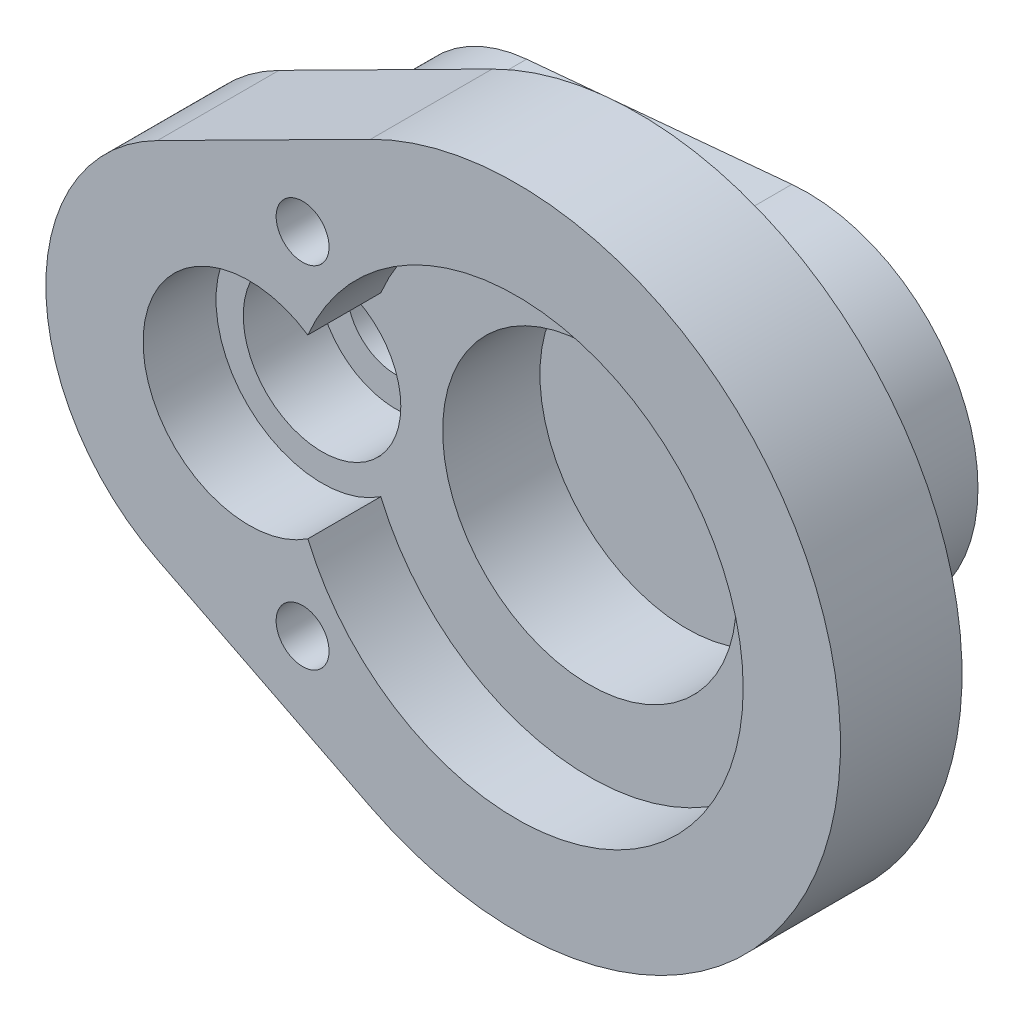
ISO-10303-21;
HEADER;
FILE_DESCRIPTION(('STEP AP214'),'2;1');
FILE_NAME('part.step','',(''),(''),'','','');
FILE_SCHEMA(('AUTOMOTIVE_DESIGN { 1 0 10303 214 1 1 1 1 }'));
ENDSEC;
DATA;
#1=APPLICATION_CONTEXT('core data for automotive mechanical design processes');
#2=APPLICATION_PROTOCOL_DEFINITION('international standard','automotive_design',2000,#1);
#3=PRODUCT_CONTEXT('',#1,'mechanical');
#4=PRODUCT('Part','Part','',(#3));
#5=PRODUCT_RELATED_PRODUCT_CATEGORY('part','',(#4));
#6=PRODUCT_DEFINITION_FORMATION('','',#4);
#7=PRODUCT_DEFINITION_CONTEXT('part definition',#1,'design');
#8=PRODUCT_DEFINITION('design','',#6,#7);
#9=PRODUCT_DEFINITION_SHAPE('','',#8);
#10=(LENGTH_UNIT() NAMED_UNIT(*) SI_UNIT(.MILLI.,.METRE.));
#11=(NAMED_UNIT(*) PLANE_ANGLE_UNIT() SI_UNIT($,.RADIAN.));
#12=(NAMED_UNIT(*) SI_UNIT($,.STERADIAN.) SOLID_ANGLE_UNIT());
#13=UNCERTAINTY_MEASURE_WITH_UNIT(LENGTH_MEASURE(1.E-05),#10,'distance_accuracy_value','');
#14=(GEOMETRIC_REPRESENTATION_CONTEXT(3) GLOBAL_UNCERTAINTY_ASSIGNED_CONTEXT((#13)) GLOBAL_UNIT_ASSIGNED_CONTEXT((#10,
#11,#12)) REPRESENTATION_CONTEXT('',''));
#15=CARTESIAN_POINT('',(0.,0.,0.));
#16=DIRECTION('',(0.,0.,1.));
#17=DIRECTION('',(1.,0.,0.));
#18=AXIS2_PLACEMENT_3D('',#15,#16,#17);
#19=CARTESIAN_POINT('',(-17.4625,0.,0.));
#20=DIRECTION('',(0.,0.,1.));
#21=DIRECTION('',(1.,0.,0.));
#22=AXIS2_PLACEMENT_3D('',#19,#20,#21);
#23=CYLINDRICAL_SURFACE('',#22,3.2004);
#24=CARTESIAN_POINT('',(-17.4625,0.,0.));
#25=DIRECTION('',(0.,0.,1.));
#26=DIRECTION('',(1.,0.,0.));
#27=AXIS2_PLACEMENT_3D('',#24,#25,#26);
#28=CIRCLE('',#27,3.2004);
#29=CARTESIAN_POINT('',(-14.2621,0.,0.));
#30=VERTEX_POINT('',#29);
#31=EDGE_CURVE('E230',#30,#30,#28,.T.);
#32=ORIENTED_EDGE('',*,*,#31,.F.);
#33=EDGE_LOOP('',(#32));
#34=FACE_BOUND('',#33,.T.);
#35=CARTESIAN_POINT('',(-17.4625,0.,9.398));
#36=DIRECTION('',(0.,0.,1.));
#37=DIRECTION('',(1.,0.,0.));
#38=AXIS2_PLACEMENT_3D('',#35,#36,#37);
#39=CIRCLE('',#38,3.2004);
#40=CARTESIAN_POINT('',(-14.2621,0.,9.398));
#41=VERTEX_POINT('',#40);
#42=EDGE_CURVE('E58',#41,#41,#39,.F.);
#43=ORIENTED_EDGE('',*,*,#42,.F.);
#44=EDGE_LOOP('',(#43));
#45=FACE_BOUND('',#44,.T.);
#46=ADVANCED_FACE('F54',(#34,#45),#23,.F.);
#47=CARTESIAN_POINT('',(-17.4625,0.,6.35));
#48=DIRECTION('',(0.,0.,-1.));
#49=DIRECTION('',(-1.,0.,0.));
#50=AXIS2_PLACEMENT_3D('',#47,#48,#49);
#51=CYLINDRICAL_SURFACE('',#50,9.5504);
#52=CARTESIAN_POINT('',(-17.4625,0.,0.));
#53=DIRECTION('',(0.,0.,1.));
#54=DIRECTION('',(1.,0.,0.));
#55=AXIS2_PLACEMENT_3D('',#52,#53,#54);
#56=CIRCLE('',#55,9.5504);
#57=CARTESIAN_POINT('',(-18.3307181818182,9.5108536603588,0.));
#58=VERTEX_POINT('',#57);
#59=CARTESIAN_POINT('',(-18.3307181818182,-9.5108536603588,0.));
#60=VERTEX_POINT('',#59);
#61=EDGE_CURVE('E323',#58,#60,#56,.T.);
#62=ORIENTED_EDGE('',*,*,#61,.T.);
#63=DIRECTION('',(0.,0.,-1.));
#64=VECTOR('',#63,1.);
#65=CARTESIAN_POINT('',(-18.3307181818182,-9.5108536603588,6.35));
#66=LINE('',#65,#64);
#67=CARTESIAN_POINT('',(-18.3307181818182,-9.5108536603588,6.35));
#68=VERTEX_POINT('',#67);
#69=EDGE_CURVE('E11',#68,#60,#66,.T.);
#70=ORIENTED_EDGE('',*,*,#69,.F.);
#71=CARTESIAN_POINT('',(-17.4625,0.,6.35));
#72=DIRECTION('',(0.,0.,1.));
#73=DIRECTION('',(1.,0.,0.));
#74=AXIS2_PLACEMENT_3D('',#71,#72,#73);
#75=CIRCLE('',#74,9.5504);
#76=CARTESIAN_POINT('',(-18.3307181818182,9.5108536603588,6.35));
#77=VERTEX_POINT('',#76);
#78=EDGE_CURVE('E324',#77,#68,#75,.T.);
#79=ORIENTED_EDGE('',*,*,#78,.F.);
#80=DIRECTION('',(0.,0.,-1.));
#81=VECTOR('',#80,1.);
#82=CARTESIAN_POINT('',(-18.3307181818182,9.5108536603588,6.35));
#83=LINE('',#82,#81);
#84=EDGE_CURVE('E338',#77,#58,#83,.T.);
#85=ORIENTED_EDGE('',*,*,#84,.T.);
#86=EDGE_LOOP('',(#62,#70,#79,#85));
#87=FACE_BOUND('',#86,.T.);
#88=ADVANCED_FACE('F56',(#87),#51,.T.);
#89=CARTESIAN_POINT('',(-18.3307181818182,-9.5108536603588,6.35));
#90=DIRECTION('',(0.0909090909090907,0.995859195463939,0.));
#91=DIRECTION('',(-0.995859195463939,0.0909090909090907,0.));
#92=AXIS2_PLACEMENT_3D('',#89,#90,#91);
#93=PLANE('',#92);
#94=DIRECTION('',(0.995859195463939,-0.0909090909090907,0.));
#95=VECTOR('',#94,1.);
#96=CARTESIAN_POINT('',(-18.3307181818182,-9.5108536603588,0.));
#97=LINE('',#96,#95);
#98=CARTESIAN_POINT('',(-1.01253636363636,-11.0917801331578,0.));
#99=VERTEX_POINT('',#98);
#100=EDGE_CURVE('E342',#60,#99,#97,.T.);
#101=ORIENTED_EDGE('',*,*,#100,.T.);
#102=DIRECTION('',(0.,0.,-1.));
#103=VECTOR('',#102,1.);
#104=CARTESIAN_POINT('',(-1.01253636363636,-11.0917801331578,6.35));
#105=LINE('',#104,#103);
#106=CARTESIAN_POINT('',(-1.01253636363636,-11.0917801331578,6.35));
#107=VERTEX_POINT('',#106);
#108=EDGE_CURVE('E64',#107,#99,#105,.T.);
#109=ORIENTED_EDGE('',*,*,#108,.F.);
#110=DIRECTION('',(0.995859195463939,-0.0909090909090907,0.));
#111=VECTOR('',#110,1.);
#112=CARTESIAN_POINT('',(-18.3307181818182,-9.5108536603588,6.35));
#113=LINE('',#112,#111);
#114=EDGE_CURVE('E105',#68,#107,#113,.T.);
#115=ORIENTED_EDGE('',*,*,#114,.F.);
#116=ORIENTED_EDGE('',*,*,#69,.T.);
#117=EDGE_LOOP('',(#101,#109,#115,#116));
#118=FACE_BOUND('',#117,.T.);
#119=ADVANCED_FACE('F390',(#118),#93,.F.);
#120=CARTESIAN_POINT('',(0.,0.,6.35));
#121=DIRECTION('',(0.,0.,-1.));
#122=DIRECTION('',(-1.,0.,0.));
#123=AXIS2_PLACEMENT_3D('',#120,#121,#122);
#124=CYLINDRICAL_SURFACE('',#123,11.1379);
#125=CARTESIAN_POINT('',(0.,0.,0.));
#126=DIRECTION('',(0.,0.,1.));
#127=DIRECTION('',(1.,0.,0.));
#128=AXIS2_PLACEMENT_3D('',#125,#126,#127);
#129=CIRCLE('',#128,11.1379);
#130=CARTESIAN_POINT('',(-1.01253636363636,11.0917801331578,0.));
#131=VERTEX_POINT('',#130);
#132=EDGE_CURVE('E345',#99,#131,#129,.T.);
#133=ORIENTED_EDGE('',*,*,#132,.T.);
#134=DIRECTION('',(0.,0.,-1.));
#135=VECTOR('',#134,1.);
#136=CARTESIAN_POINT('',(-1.01253636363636,11.0917801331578,6.35));
#137=LINE('',#136,#135);
#138=CARTESIAN_POINT('',(-1.01253636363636,11.0917801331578,6.35));
#139=VERTEX_POINT('',#138);
#140=EDGE_CURVE('E80',#139,#131,#137,.T.);
#141=ORIENTED_EDGE('',*,*,#140,.F.);
#142=CARTESIAN_POINT('',(0.,0.,6.35));
#143=DIRECTION('',(0.,0.,1.));
#144=DIRECTION('',(1.,0.,0.));
#145=AXIS2_PLACEMENT_3D('',#142,#143,#144);
#146=CIRCLE('',#145,11.1379);
#147=EDGE_CURVE('E330',#107,#139,#146,.T.);
#148=ORIENTED_EDGE('',*,*,#147,.F.);
#149=ORIENTED_EDGE('',*,*,#108,.T.);
#150=EDGE_LOOP('',(#133,#141,#148,#149));
#151=FACE_BOUND('',#150,.T.);
#152=ADVANCED_FACE('F357',(#151),#124,.T.);
#153=CARTESIAN_POINT('',(-18.3307181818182,9.5108536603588,6.35));
#154=DIRECTION('',(0.0909090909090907,-0.995859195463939,0.));
#155=DIRECTION('',(0.995859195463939,0.0909090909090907,0.));
#156=AXIS2_PLACEMENT_3D('',#153,#154,#155);
#157=PLANE('',#156);
#158=DIRECTION('',(-0.995859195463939,-0.0909090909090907,0.));
#159=VECTOR('',#158,1.);
#160=CARTESIAN_POINT('',(-18.3307181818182,9.5108536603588,0.));
#161=LINE('',#160,#159);
#162=EDGE_CURVE('E100',#131,#58,#161,.T.);
#163=ORIENTED_EDGE('',*,*,#162,.T.);
#164=ORIENTED_EDGE('',*,*,#84,.F.);
#165=DIRECTION('',(-0.995859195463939,-0.0909090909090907,0.));
#166=VECTOR('',#165,1.);
#167=CARTESIAN_POINT('',(-18.3307181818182,9.5108536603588,6.35));
#168=LINE('',#167,#166);
#169=EDGE_CURVE('E334',#139,#77,#168,.T.);
#170=ORIENTED_EDGE('',*,*,#169,.F.);
#171=ORIENTED_EDGE('',*,*,#140,.T.);
#172=EDGE_LOOP('',(#163,#164,#170,#171));
#173=FACE_BOUND('',#172,.T.);
#174=ADVANCED_FACE('F362',(#173),#157,.F.);
#175=CARTESIAN_POINT('',(-17.4625,0.,0.));
#176=DIRECTION('',(0.,0.,1.));
#177=DIRECTION('',(1.,0.,0.));
#178=AXIS2_PLACEMENT_3D('',#175,#176,#177);
#179=PLANE('',#178);
#180=ORIENTED_EDGE('',*,*,#31,.T.);
#181=EDGE_LOOP('',(#180));
#182=FACE_BOUND('',#181,.T.);
#183=ORIENTED_EDGE('',*,*,#61,.F.);
#184=ORIENTED_EDGE('',*,*,#162,.F.);
#185=ORIENTED_EDGE('',*,*,#132,.F.);
#186=ORIENTED_EDGE('',*,*,#100,.F.);
#187=EDGE_LOOP('',(#183,#184,#185,#186));
#188=FACE_BOUND('',#187,.T.);
#189=ADVANCED_FACE('F360',(#182,#188),#179,.F.);
#190=CARTESIAN_POINT('',(-17.4625,0.,6.35));
#191=DIRECTION('',(0.,0.,1.));
#192=DIRECTION('',(1.,0.,0.));
#193=AXIS2_PLACEMENT_3D('',#190,#191,#192);
#194=PLANE('',#193);
#195=CARTESIAN_POINT('',(-17.4625,0.,6.35));
#196=DIRECTION('',(0.,0.,1.));
#197=DIRECTION('',(1.,0.,0.));
#198=AXIS2_PLACEMENT_3D('',#195,#196,#197);
#199=CIRCLE('',#198,9.906);
#200=CARTESIAN_POINT('',(-19.9840272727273,9.57970439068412,6.35));
#201=VERTEX_POINT('',#200);
#202=CARTESIAN_POINT('',(-19.9840272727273,-9.57970439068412,6.35));
#203=VERTEX_POINT('',#202);
#204=EDGE_CURVE('E278',#201,#203,#199,.T.);
#205=ORIENTED_EDGE('',*,*,#204,.F.);
#206=DIRECTION('',(-0.967060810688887,-0.254545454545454,0.));
#207=VECTOR('',#206,1.);
#208=CARTESIAN_POINT('',(-19.9840272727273,9.57970439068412,6.35));
#209=LINE('',#208,#207);
#210=CARTESIAN_POINT('',(-3.65298181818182,13.8782896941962,6.35));
#211=VERTEX_POINT('',#210);
#212=EDGE_CURVE('E284',#211,#201,#209,.T.);
#213=ORIENTED_EDGE('',*,*,#212,.F.);
#214=CARTESIAN_POINT('',(0.,0.,6.35));
#215=DIRECTION('',(0.,0.,1.));
#216=DIRECTION('',(1.,0.,0.));
#217=AXIS2_PLACEMENT_3D('',#214,#215,#216);
#218=CIRCLE('',#217,14.351);
#219=CARTESIAN_POINT('',(-3.65298181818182,-13.8782896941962,6.35));
#220=VERTEX_POINT('',#219);
#221=EDGE_CURVE('E303',#220,#211,#218,.T.);
#222=ORIENTED_EDGE('',*,*,#221,.F.);
#223=DIRECTION('',(0.967060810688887,-0.254545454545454,0.));
#224=VECTOR('',#223,1.);
#225=CARTESIAN_POINT('',(-19.9840272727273,-9.57970439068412,6.35));
#226=LINE('',#225,#224);
#227=EDGE_CURVE('E300',#203,#220,#226,.T.);
#228=ORIENTED_EDGE('',*,*,#227,.F.);
#229=EDGE_LOOP('',(#205,#213,#222,#228));
#230=FACE_BOUND('',#229,.T.);
#231=ORIENTED_EDGE('',*,*,#169,.T.);
#232=ORIENTED_EDGE('',*,*,#78,.T.);
#233=ORIENTED_EDGE('',*,*,#114,.T.);
#234=ORIENTED_EDGE('',*,*,#147,.T.);
#235=EDGE_LOOP('',(#231,#232,#233,#234));
#236=FACE_BOUND('',#235,.T.);
#237=ADVANCED_FACE('F364',(#230,#236),#194,.F.);
#238=CARTESIAN_POINT('',(-17.4625,0.,11.049));
#239=DIRECTION('',(0.,0.,-1.));
#240=DIRECTION('',(-1.,0.,0.));
#241=AXIS2_PLACEMENT_3D('',#238,#239,#240);
#242=CYLINDRICAL_SURFACE('',#241,9.906);
#243=ORIENTED_EDGE('',*,*,#204,.T.);
#244=DIRECTION('',(0.,0.,-1.));
#245=VECTOR('',#244,1.);
#246=CARTESIAN_POINT('',(-19.9840272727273,-9.57970439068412,11.049));
#247=LINE('',#246,#245);
#248=CARTESIAN_POINT('',(-19.9840272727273,-9.57970439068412,11.049));
#249=VERTEX_POINT('',#248);
#250=EDGE_CURVE('E319',#249,#203,#247,.T.);
#251=ORIENTED_EDGE('',*,*,#250,.F.);
#252=CARTESIAN_POINT('',(-17.4625,0.,11.049));
#253=DIRECTION('',(0.,0.,1.));
#254=DIRECTION('',(1.,0.,0.));
#255=AXIS2_PLACEMENT_3D('',#252,#253,#254);
#256=CIRCLE('',#255,9.906);
#257=CARTESIAN_POINT('',(-19.9840272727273,9.57970439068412,11.049));
#258=VERTEX_POINT('',#257);
#259=EDGE_CURVE('E279',#258,#249,#256,.T.);
#260=ORIENTED_EDGE('',*,*,#259,.F.);
#261=DIRECTION('',(0.,0.,-1.));
#262=VECTOR('',#261,1.);
#263=CARTESIAN_POINT('',(-19.9840272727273,9.57970439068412,11.049));
#264=LINE('',#263,#262);
#265=EDGE_CURVE('E296',#258,#201,#264,.T.);
#266=ORIENTED_EDGE('',*,*,#265,.T.);
#267=EDGE_LOOP('',(#243,#251,#260,#266));
#268=FACE_BOUND('',#267,.T.);
#269=ADVANCED_FACE('F366',(#268),#242,.T.);
#270=CARTESIAN_POINT('',(-19.9840272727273,-9.57970439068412,11.049));
#271=DIRECTION('',(0.254545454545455,0.967060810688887,0.));
#272=DIRECTION('',(-0.967060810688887,0.254545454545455,0.));
#273=AXIS2_PLACEMENT_3D('',#270,#271,#272);
#274=PLANE('',#273);
#275=ORIENTED_EDGE('',*,*,#227,.T.);
#276=DIRECTION('',(0.,0.,-1.));
#277=VECTOR('',#276,1.);
#278=CARTESIAN_POINT('',(-3.65298181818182,-13.8782896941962,11.049));
#279=LINE('',#278,#277);
#280=CARTESIAN_POINT('',(-3.65298181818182,-13.8782896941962,11.049));
#281=VERTEX_POINT('',#280);
#282=EDGE_CURVE('E315',#281,#220,#279,.T.);
#283=ORIENTED_EDGE('',*,*,#282,.F.);
#284=DIRECTION('',(0.967060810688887,-0.254545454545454,0.));
#285=VECTOR('',#284,1.);
#286=CARTESIAN_POINT('',(-19.9840272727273,-9.57970439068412,11.049));
#287=LINE('',#286,#285);
#288=EDGE_CURVE('E283',#249,#281,#287,.T.);
#289=ORIENTED_EDGE('',*,*,#288,.F.);
#290=ORIENTED_EDGE('',*,*,#250,.T.);
#291=EDGE_LOOP('',(#275,#283,#289,#290));
#292=FACE_BOUND('',#291,.T.);
#293=ADVANCED_FACE('F373',(#292),#274,.F.);
#294=CARTESIAN_POINT('',(0.,0.,11.049));
#295=DIRECTION('',(0.,0.,-1.));
#296=DIRECTION('',(-1.,0.,0.));
#297=AXIS2_PLACEMENT_3D('',#294,#295,#296);
#298=CYLINDRICAL_SURFACE('',#297,14.351);
#299=ORIENTED_EDGE('',*,*,#221,.T.);
#300=DIRECTION('',(0.,0.,-1.));
#301=VECTOR('',#300,1.);
#302=CARTESIAN_POINT('',(-3.65298181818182,13.8782896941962,11.049));
#303=LINE('',#302,#301);
#304=CARTESIAN_POINT('',(-3.65298181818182,13.8782896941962,11.049));
#305=VERTEX_POINT('',#304);
#306=EDGE_CURVE('E311',#305,#211,#303,.T.);
#307=ORIENTED_EDGE('',*,*,#306,.F.);
#308=CARTESIAN_POINT('',(0.,0.,11.049));
#309=DIRECTION('',(0.,0.,1.));
#310=DIRECTION('',(1.,0.,0.));
#311=AXIS2_PLACEMENT_3D('',#308,#309,#310);
#312=CIRCLE('',#311,14.351);
#313=EDGE_CURVE('E288',#281,#305,#312,.T.);
#314=ORIENTED_EDGE('',*,*,#313,.F.);
#315=ORIENTED_EDGE('',*,*,#282,.T.);
#316=EDGE_LOOP('',(#299,#307,#314,#315));
#317=FACE_BOUND('',#316,.T.);
#318=ADVANCED_FACE('F444',(#317),#298,.T.);
#319=CARTESIAN_POINT('',(-19.9840272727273,9.57970439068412,11.049));
#320=DIRECTION('',(0.254545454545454,-0.967060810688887,0.));
#321=DIRECTION('',(0.967060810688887,0.254545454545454,0.));
#322=AXIS2_PLACEMENT_3D('',#319,#320,#321);
#323=PLANE('',#322);
#324=ORIENTED_EDGE('',*,*,#212,.T.);
#325=ORIENTED_EDGE('',*,*,#265,.F.);
#326=DIRECTION('',(-0.967060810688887,-0.254545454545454,0.));
#327=VECTOR('',#326,1.);
#328=CARTESIAN_POINT('',(-19.9840272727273,9.57970439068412,11.049));
#329=LINE('',#328,#327);
#330=EDGE_CURVE('E292',#305,#258,#329,.T.);
#331=ORIENTED_EDGE('',*,*,#330,.F.);
#332=ORIENTED_EDGE('',*,*,#306,.T.);
#333=EDGE_LOOP('',(#324,#325,#331,#332));
#334=FACE_BOUND('',#333,.T.);
#335=ADVANCED_FACE('F407',(#334),#323,.F.);
#336=CARTESIAN_POINT('',(-17.4625,0.,11.049));
#337=DIRECTION('',(0.,0.,1.));
#338=DIRECTION('',(1.,0.,0.));
#339=AXIS2_PLACEMENT_3D('',#336,#337,#338);
#340=PLANE('',#339);
#341=CARTESIAN_POINT('',(-17.4625,0.,11.049));
#342=DIRECTION('',(0.,0.,1.));
#343=DIRECTION('',(1.,0.,0.));
#344=AXIS2_PLACEMENT_3D('',#341,#342,#343);
#345=CIRCLE('',#344,13.2715);
#346=CARTESIAN_POINT('',(-23.44674,11.8457411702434,11.049));
#347=VERTEX_POINT('',#346);
#348=CARTESIAN_POINT('',(-23.44674,-11.8457411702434,11.049));
#349=VERTEX_POINT('',#348);
#350=EDGE_CURVE('E236',#347,#349,#345,.T.);
#351=ORIENTED_EDGE('',*,*,#350,.F.);
#352=DIRECTION('',(-0.89256988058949,-0.450909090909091,0.));
#353=VECTOR('',#352,1.);
#354=CARTESIAN_POINT('',(-23.44674,11.8457411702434,11.049));
#355=LINE('',#354,#353);
#356=CARTESIAN_POINT('',(-9.53469818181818,18.8738364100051,11.049));
#357=VERTEX_POINT('',#356);
#358=EDGE_CURVE('E242',#357,#347,#355,.T.);
#359=ORIENTED_EDGE('',*,*,#358,.F.);
#360=CARTESIAN_POINT('',(0.,0.,11.049));
#361=DIRECTION('',(0.,0.,1.));
#362=DIRECTION('',(1.,0.,0.));
#363=AXIS2_PLACEMENT_3D('',#360,#361,#362);
#364=CIRCLE('',#363,21.1455);
#365=CARTESIAN_POINT('',(-9.53469818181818,-18.8738364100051,11.049));
#366=VERTEX_POINT('',#365);
#367=EDGE_CURVE('E258',#366,#357,#364,.T.);
#368=ORIENTED_EDGE('',*,*,#367,.F.);
#369=DIRECTION('',(0.89256988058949,-0.450909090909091,0.));
#370=VECTOR('',#369,1.);
#371=CARTESIAN_POINT('',(-23.44674,-11.8457411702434,11.049));
#372=LINE('',#371,#370);
#373=EDGE_CURVE('E255',#349,#366,#372,.T.);
#374=ORIENTED_EDGE('',*,*,#373,.F.);
#375=EDGE_LOOP('',(#351,#359,#368,#374));
#376=FACE_BOUND('',#375,.T.);
#377=ORIENTED_EDGE('',*,*,#330,.T.);
#378=ORIENTED_EDGE('',*,*,#259,.T.);
#379=ORIENTED_EDGE('',*,*,#288,.T.);
#380=ORIENTED_EDGE('',*,*,#313,.T.);
#381=EDGE_LOOP('',(#377,#378,#379,#380));
#382=FACE_BOUND('',#381,.T.);
#383=ADVANCED_FACE('F403',(#376,#382),#340,.F.);
#384=CARTESIAN_POINT('',(-17.4625,0.,18.9865));
#385=DIRECTION('',(0.,0.,-1.));
#386=DIRECTION('',(-1.,0.,0.));
#387=AXIS2_PLACEMENT_3D('',#384,#385,#386);
#388=CYLINDRICAL_SURFACE('',#387,13.2715);
#389=ORIENTED_EDGE('',*,*,#350,.T.);
#390=DIRECTION('',(0.,0.,-1.));
#391=VECTOR('',#390,1.);
#392=CARTESIAN_POINT('',(-23.44674,-11.8457411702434,18.9865));
#393=LINE('',#392,#391);
#394=CARTESIAN_POINT('',(-23.44674,-11.8457411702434,18.9865));
#395=VERTEX_POINT('',#394);
#396=EDGE_CURVE('E274',#395,#349,#393,.T.);
#397=ORIENTED_EDGE('',*,*,#396,.F.);
#398=CARTESIAN_POINT('',(-17.4625,0.,18.9865));
#399=DIRECTION('',(0.,0.,1.));
#400=DIRECTION('',(1.,0.,0.));
#401=AXIS2_PLACEMENT_3D('',#398,#399,#400);
#402=CIRCLE('',#401,13.2715);
#403=CARTESIAN_POINT('',(-23.44674,11.8457411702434,18.9865));
#404=VERTEX_POINT('',#403);
#405=EDGE_CURVE('E237',#404,#395,#402,.T.);
#406=ORIENTED_EDGE('',*,*,#405,.F.);
#407=DIRECTION('',(0.,0.,-1.));
#408=VECTOR('',#407,1.);
#409=CARTESIAN_POINT('',(-23.44674,11.8457411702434,18.9865));
#410=LINE('',#409,#408);
#411=EDGE_CURVE('E251',#404,#347,#410,.T.);
#412=ORIENTED_EDGE('',*,*,#411,.T.);
#413=EDGE_LOOP('',(#389,#397,#406,#412));
#414=FACE_BOUND('',#413,.T.);
#415=ADVANCED_FACE('F406',(#414),#388,.T.);
#416=CARTESIAN_POINT('',(-23.44674,-11.8457411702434,18.9865));
#417=DIRECTION('',(0.450909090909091,0.892569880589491,0.));
#418=DIRECTION('',(-0.89256988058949,0.450909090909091,0.));
#419=AXIS2_PLACEMENT_3D('',#416,#417,#418);
#420=PLANE('',#419);
#421=ORIENTED_EDGE('',*,*,#373,.T.);
#422=DIRECTION('',(0.,0.,-1.));
#423=VECTOR('',#422,1.);
#424=CARTESIAN_POINT('',(-9.53469818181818,-18.8738364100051,18.9865));
#425=LINE('',#424,#423);
#426=CARTESIAN_POINT('',(-9.53469818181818,-18.8738364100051,18.9865));
#427=VERTEX_POINT('',#426);
#428=EDGE_CURVE('E270',#427,#366,#425,.T.);
#429=ORIENTED_EDGE('',*,*,#428,.F.);
#430=DIRECTION('',(0.89256988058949,-0.450909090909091,0.));
#431=VECTOR('',#430,1.);
#432=CARTESIAN_POINT('',(-23.44674,-11.8457411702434,18.9865));
#433=LINE('',#432,#431);
#434=EDGE_CURVE('E241',#395,#427,#433,.T.);
#435=ORIENTED_EDGE('',*,*,#434,.F.);
#436=ORIENTED_EDGE('',*,*,#396,.T.);
#437=EDGE_LOOP('',(#421,#429,#435,#436));
#438=FACE_BOUND('',#437,.T.);
#439=ADVANCED_FACE('F415',(#438),#420,.F.);
#440=CARTESIAN_POINT('',(0.,0.,18.9865));
#441=DIRECTION('',(0.,0.,-1.));
#442=DIRECTION('',(-1.,0.,0.));
#443=AXIS2_PLACEMENT_3D('',#440,#441,#442);
#444=CYLINDRICAL_SURFACE('',#443,21.1455);
#445=ORIENTED_EDGE('',*,*,#367,.T.);
#446=DIRECTION('',(0.,0.,-1.));
#447=VECTOR('',#446,1.);
#448=CARTESIAN_POINT('',(-9.53469818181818,18.8738364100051,18.9865));
#449=LINE('',#448,#447);
#450=CARTESIAN_POINT('',(-9.53469818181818,18.8738364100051,18.9865));
#451=VERTEX_POINT('',#450);
#452=EDGE_CURVE('E266',#451,#357,#449,.T.);
#453=ORIENTED_EDGE('',*,*,#452,.F.);
#454=CARTESIAN_POINT('',(0.,0.,18.9865));
#455=DIRECTION('',(0.,0.,1.));
#456=DIRECTION('',(1.,0.,0.));
#457=AXIS2_PLACEMENT_3D('',#454,#455,#456);
#458=CIRCLE('',#457,21.1455);
#459=EDGE_CURVE('E245',#427,#451,#458,.T.);
#460=ORIENTED_EDGE('',*,*,#459,.F.);
#461=ORIENTED_EDGE('',*,*,#428,.T.);
#462=EDGE_LOOP('',(#445,#453,#460,#461));
#463=FACE_BOUND('',#462,.T.);
#464=ADVANCED_FACE('F411',(#463),#444,.T.);
#465=CARTESIAN_POINT('',(-23.44674,11.8457411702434,18.9865));
#466=DIRECTION('',(0.450909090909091,-0.892569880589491,0.));
#467=DIRECTION('',(0.892569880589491,0.450909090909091,0.));
#468=AXIS2_PLACEMENT_3D('',#465,#466,#467);
#469=PLANE('',#468);
#470=ORIENTED_EDGE('',*,*,#358,.T.);
#471=ORIENTED_EDGE('',*,*,#411,.F.);
#472=DIRECTION('',(-0.89256988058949,-0.450909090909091,0.));
#473=VECTOR('',#472,1.);
#474=CARTESIAN_POINT('',(-23.44674,11.8457411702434,18.9865));
#475=LINE('',#474,#473);
#476=EDGE_CURVE('E248',#451,#404,#475,.T.);
#477=ORIENTED_EDGE('',*,*,#476,.F.);
#478=ORIENTED_EDGE('',*,*,#452,.T.);
#479=EDGE_LOOP('',(#470,#471,#477,#478));
#480=FACE_BOUND('',#479,.T.);
#481=ADVANCED_FACE('F401',(#480),#469,.F.);
#482=CARTESIAN_POINT('',(-17.4625,0.,18.9865));
#483=DIRECTION('',(0.,0.,1.));
#484=DIRECTION('',(1.,0.,0.));
#485=AXIS2_PLACEMENT_3D('',#482,#483,#484);
#486=PLANE('',#485);
#487=CARTESIAN_POINT('',(-13.97,11.43,18.9865));
#488=DIRECTION('',(0.,0.,1.));
#489=DIRECTION('',(1.,0.,0.));
#490=AXIS2_PLACEMENT_3D('',#487,#488,#489);
#491=CIRCLE('',#490,1.7272);
#492=CARTESIAN_POINT('',(-12.2428,11.43,18.9865));
#493=VERTEX_POINT('',#492);
#494=EDGE_CURVE('E183',#493,#493,#491,.T.);
#495=ORIENTED_EDGE('',*,*,#494,.F.);
#496=EDGE_LOOP('',(#495));
#497=FACE_BOUND('',#496,.T.);
#498=CARTESIAN_POINT('',(-13.97,-11.43,18.9865));
#499=DIRECTION('',(0.,0.,1.));
#500=DIRECTION('',(1.,0.,0.));
#501=AXIS2_PLACEMENT_3D('',#498,#499,#500);
#502=CIRCLE('',#501,1.7272);
#503=CARTESIAN_POINT('',(-12.2428,-11.43,18.9865));
#504=VERTEX_POINT('',#503);
#505=EDGE_CURVE('E182',#504,#504,#502,.T.);
#506=ORIENTED_EDGE('',*,*,#505,.F.);
#507=EDGE_LOOP('',(#506));
#508=FACE_BOUND('',#507,.T.);
#509=CARTESIAN_POINT('',(-17.4625,0.,18.9865));
#510=DIRECTION('',(0.,0.,1.));
#511=DIRECTION('',(1.,0.,0.));
#512=AXIS2_PLACEMENT_3D('',#509,#510,#511);
#513=CIRCLE('',#512,6.9215);
#514=CARTESIAN_POINT('',(-13.6274463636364,5.76190297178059,18.9865));
#515=VERTEX_POINT('',#514);
#516=CARTESIAN_POINT('',(-13.6274463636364,-5.76190297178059,18.9865));
#517=VERTEX_POINT('',#516);
#518=EDGE_CURVE('E71',#515,#517,#513,.T.);
#519=ORIENTED_EDGE('',*,*,#518,.F.);
#520=CARTESIAN_POINT('',(0.,0.,18.9865));
#521=DIRECTION('',(0.,0.,1.));
#522=DIRECTION('',(1.,0.,0.));
#523=AXIS2_PLACEMENT_3D('',#520,#521,#522);
#524=CIRCLE('',#523,14.7955);
#525=EDGE_CURVE('E217',#517,#515,#524,.T.);
#526=ORIENTED_EDGE('',*,*,#525,.F.);
#527=EDGE_LOOP('',(#519,#526));
#528=FACE_BOUND('',#527,.T.);
#529=ORIENTED_EDGE('',*,*,#405,.T.);
#530=ORIENTED_EDGE('',*,*,#434,.T.);
#531=ORIENTED_EDGE('',*,*,#459,.T.);
#532=ORIENTED_EDGE('',*,*,#476,.T.);
#533=EDGE_LOOP('',(#529,#530,#531,#532));
#534=FACE_BOUND('',#533,.T.);
#535=ADVANCED_FACE('F397',(#497,#508,#528,#534),#486,.T.);
#536=CARTESIAN_POINT('',(-8.73125,0.,14.224));
#537=DIRECTION('',(0.,0.,1.));
#538=DIRECTION('',(1.,0.,0.));
#539=AXIS2_PLACEMENT_3D('',#536,#537,#538);
#540=PLANE('',#539);
#541=CARTESIAN_POINT('',(-17.4625,0.,14.224));
#542=DIRECTION('',(0.,0.,1.));
#543=DIRECTION('',(1.,0.,0.));
#544=AXIS2_PLACEMENT_3D('',#541,#542,#543);
#545=CIRCLE('',#544,5.1435);
#546=CARTESIAN_POINT('',(-12.319,0.,14.224));
#547=VERTEX_POINT('',#546);
#548=EDGE_CURVE('E196',#547,#547,#545,.T.);
#549=ORIENTED_EDGE('',*,*,#548,.F.);
#550=EDGE_LOOP('',(#549));
#551=FACE_BOUND('',#550,.T.);
#552=CARTESIAN_POINT('',(0.,0.,14.224));
#553=DIRECTION('',(0.,0.,1.));
#554=DIRECTION('',(1.,0.,0.));
#555=AXIS2_PLACEMENT_3D('',#552,#553,#554);
#556=CIRCLE('',#555,9.5885);
#557=CARTESIAN_POINT('',(9.5885,0.,14.224));
#558=VERTEX_POINT('',#557);
#559=EDGE_CURVE('E208',#558,#558,#556,.T.);
#560=ORIENTED_EDGE('',*,*,#559,.F.);
#561=EDGE_LOOP('',(#560));
#562=FACE_BOUND('',#561,.T.);
#563=CARTESIAN_POINT('',(-17.4625,0.,14.224));
#564=DIRECTION('',(0.,0.,1.));
#565=DIRECTION('',(1.,0.,0.));
#566=AXIS2_PLACEMENT_3D('',#563,#564,#565);
#567=CIRCLE('',#566,6.9215);
#568=CARTESIAN_POINT('',(-13.6274463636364,5.76190297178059,14.224));
#569=VERTEX_POINT('',#568);
#570=CARTESIAN_POINT('',(-13.6274463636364,-5.76190297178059,14.224));
#571=VERTEX_POINT('',#570);
#572=EDGE_CURVE('E212',#569,#571,#567,.T.);
#573=ORIENTED_EDGE('',*,*,#572,.T.);
#574=CARTESIAN_POINT('',(0.,0.,14.224));
#575=DIRECTION('',(0.,0.,1.));
#576=DIRECTION('',(1.,0.,0.));
#577=AXIS2_PLACEMENT_3D('',#574,#575,#576);
#578=CIRCLE('',#577,14.7955);
#579=EDGE_CURVE('E216',#571,#569,#578,.T.);
#580=ORIENTED_EDGE('',*,*,#579,.T.);
#581=EDGE_LOOP('',(#573,#580));
#582=FACE_BOUND('',#581,.T.);
#583=ADVANCED_FACE('F400',(#551,#562,#582),#540,.T.);
#584=CARTESIAN_POINT('',(-17.4625,0.,14.224));
#585=DIRECTION('',(0.,0.,1.));
#586=DIRECTION('',(1.,0.,0.));
#587=AXIS2_PLACEMENT_3D('',#584,#585,#586);
#588=CYLINDRICAL_SURFACE('',#587,6.9215);
#589=ORIENTED_EDGE('',*,*,#518,.T.);
#590=DIRECTION('',(0.,0.,1.));
#591=VECTOR('',#590,1.);
#592=CARTESIAN_POINT('',(-13.6274463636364,-5.76190297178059,14.224));
#593=LINE('',#592,#591);
#594=EDGE_CURVE('E221',#571,#517,#593,.T.);
#595=ORIENTED_EDGE('',*,*,#594,.F.);
#596=ORIENTED_EDGE('',*,*,#572,.F.);
#597=DIRECTION('',(0.,0.,1.));
#598=VECTOR('',#597,1.);
#599=CARTESIAN_POINT('',(-13.6274463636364,5.76190297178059,14.224));
#600=LINE('',#599,#598);
#601=EDGE_CURVE('E227',#569,#515,#600,.T.);
#602=ORIENTED_EDGE('',*,*,#601,.T.);
#603=EDGE_LOOP('',(#589,#595,#596,#602));
#604=FACE_BOUND('',#603,.T.);
#605=ADVANCED_FACE('F395',(#604),#588,.F.);
#606=CARTESIAN_POINT('',(0.,0.,14.224));
#607=DIRECTION('',(0.,0.,1.));
#608=DIRECTION('',(1.,0.,0.));
#609=AXIS2_PLACEMENT_3D('',#606,#607,#608);
#610=CYLINDRICAL_SURFACE('',#609,14.7955);
#611=ORIENTED_EDGE('',*,*,#525,.T.);
#612=ORIENTED_EDGE('',*,*,#601,.F.);
#613=ORIENTED_EDGE('',*,*,#579,.F.);
#614=ORIENTED_EDGE('',*,*,#594,.T.);
#615=EDGE_LOOP('',(#611,#612,#613,#614));
#616=FACE_BOUND('',#615,.T.);
#617=ADVANCED_FACE('F557',(#616),#610,.F.);
#618=CARTESIAN_POINT('',(0.,0.,7.874));
#619=DIRECTION('',(0.,0.,1.));
#620=DIRECTION('',(1.,0.,0.));
#621=AXIS2_PLACEMENT_3D('',#618,#619,#620);
#622=CYLINDRICAL_SURFACE('',#621,9.5885);
#623=CARTESIAN_POINT('',(0.,0.,7.874));
#624=DIRECTION('',(0.,0.,1.));
#625=DIRECTION('',(1.,0.,0.));
#626=AXIS2_PLACEMENT_3D('',#623,#624,#625);
#627=CIRCLE('',#626,9.5885);
#628=CARTESIAN_POINT('',(9.5885,0.,7.874));
#629=VERTEX_POINT('',#628);
#630=EDGE_CURVE('E204',#629,#629,#627,.T.);
#631=ORIENTED_EDGE('',*,*,#630,.F.);
#632=EDGE_LOOP('',(#631));
#633=FACE_BOUND('',#632,.T.);
#634=ORIENTED_EDGE('',*,*,#559,.T.);
#635=EDGE_LOOP('',(#634));
#636=FACE_BOUND('',#635,.T.);
#637=ADVANCED_FACE('F565',(#633,#636),#622,.F.);
#638=CARTESIAN_POINT('',(0.,0.,7.874));
#639=DIRECTION('',(0.,0.,1.));
#640=DIRECTION('',(1.,0.,0.));
#641=AXIS2_PLACEMENT_3D('',#638,#639,#640);
#642=PLANE('',#641);
#643=ORIENTED_EDGE('',*,*,#630,.T.);
#644=EDGE_LOOP('',(#643));
#645=FACE_BOUND('',#644,.T.);
#646=ADVANCED_FACE('F574',(#645),#642,.T.);
#647=CARTESIAN_POINT('',(-17.4625,0.,9.398));
#648=DIRECTION('',(0.,0.,1.));
#649=DIRECTION('',(1.,0.,0.));
#650=AXIS2_PLACEMENT_3D('',#647,#648,#649);
#651=PLANE('',#650);
#652=CARTESIAN_POINT('',(-17.4625,0.,9.398));
#653=DIRECTION('',(0.,0.,1.));
#654=DIRECTION('',(1.,0.,0.));
#655=AXIS2_PLACEMENT_3D('',#652,#653,#654);
#656=CIRCLE('',#655,5.1435);
#657=CARTESIAN_POINT('',(-12.319,0.,9.398));
#658=VERTEX_POINT('',#657);
#659=EDGE_CURVE('E197',#658,#658,#656,.T.);
#660=ORIENTED_EDGE('',*,*,#659,.T.);
#661=EDGE_LOOP('',(#660));
#662=FACE_BOUND('',#661,.T.);
#663=ORIENTED_EDGE('',*,*,#42,.T.);
#664=EDGE_LOOP('',(#663));
#665=FACE_BOUND('',#664,.T.);
#666=ADVANCED_FACE('F582',(#662,#665),#651,.T.);
#667=CARTESIAN_POINT('',(-17.4625,0.,9.398));
#668=DIRECTION('',(0.,0.,1.));
#669=DIRECTION('',(1.,0.,0.));
#670=AXIS2_PLACEMENT_3D('',#667,#668,#669);
#671=CYLINDRICAL_SURFACE('',#670,5.1435);
#672=ORIENTED_EDGE('',*,*,#659,.F.);
#673=EDGE_LOOP('',(#672));
#674=FACE_BOUND('',#673,.T.);
#675=ORIENTED_EDGE('',*,*,#548,.T.);
#676=EDGE_LOOP('',(#675));
#677=FACE_BOUND('',#676,.T.);
#678=ADVANCED_FACE('F596',(#674,#677),#671,.F.);
#679=CARTESIAN_POINT('',(-13.97,-11.43,12.6365));
#680=DIRECTION('',(0.,0.,1.));
#681=DIRECTION('',(1.,0.,0.));
#682=AXIS2_PLACEMENT_3D('',#679,#680,#681);
#683=CONICAL_SURFACE('',#682,1.7272,1.02974425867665);
#684=CARTESIAN_POINT('',(-13.97,-11.43,11.5986935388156));
#685=VERTEX_POINT('',#684);
#686=VERTEX_LOOP('',#685);
#687=FACE_BOUND('',#686,.T.);
#688=CARTESIAN_POINT('',(-13.97,-11.43,12.6365));
#689=DIRECTION('',(0.,0.,1.));
#690=DIRECTION('',(1.,0.,0.));
#691=AXIS2_PLACEMENT_3D('',#688,#689,#690);
#692=CIRCLE('',#691,1.7272);
#693=CARTESIAN_POINT('',(-12.2428,-11.43,12.6365));
#694=VERTEX_POINT('',#693);
#695=EDGE_CURVE('E188',#694,#694,#692,.T.);
#696=ORIENTED_EDGE('',*,*,#695,.T.);
#697=EDGE_LOOP('',(#696));
#698=FACE_BOUND('',#697,.T.);
#699=ADVANCED_FACE('F606',(#687,#698),#683,.F.);
#700=CARTESIAN_POINT('',(-13.97,-11.43,18.9865));
#701=DIRECTION('',(0.,0.,1.));
#702=DIRECTION('',(1.,0.,0.));
#703=AXIS2_PLACEMENT_3D('',#700,#701,#702);
#704=CYLINDRICAL_SURFACE('',#703,1.7272);
#705=ORIENTED_EDGE('',*,*,#695,.F.);
#706=EDGE_LOOP('',(#705));
#707=FACE_BOUND('',#706,.T.);
#708=ORIENTED_EDGE('',*,*,#505,.T.);
#709=EDGE_LOOP('',(#708));
#710=FACE_BOUND('',#709,.T.);
#711=ADVANCED_FACE('F175',(#707,#710),#704,.F.);
#712=CARTESIAN_POINT('',(-13.97,11.43,12.6365));
#713=DIRECTION('',(0.,0.,1.));
#714=DIRECTION('',(1.,0.,0.));
#715=AXIS2_PLACEMENT_3D('',#712,#713,#714);
#716=CONICAL_SURFACE('',#715,1.7272,1.02974425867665);
#717=CARTESIAN_POINT('',(-13.97,11.43,11.5986935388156));
#718=VERTEX_POINT('',#717);
#719=VERTEX_LOOP('',#718);
#720=FACE_BOUND('',#719,.T.);
#721=CARTESIAN_POINT('',(-13.97,11.43,12.6365));
#722=DIRECTION('',(0.,0.,1.));
#723=DIRECTION('',(1.,0.,0.));
#724=AXIS2_PLACEMENT_3D('',#721,#722,#723);
#725=CIRCLE('',#724,1.7272);
#726=CARTESIAN_POINT('',(-12.2428,11.43,12.6365));
#727=VERTEX_POINT('',#726);
#728=EDGE_CURVE('E179',#727,#727,#725,.T.);
#729=ORIENTED_EDGE('',*,*,#728,.T.);
#730=EDGE_LOOP('',(#729));
#731=FACE_BOUND('',#730,.T.);
#732=ADVANCED_FACE('F171',(#720,#731),#716,.F.);
#733=CARTESIAN_POINT('',(-13.97,11.43,18.9865));
#734=DIRECTION('',(0.,0.,1.));
#735=DIRECTION('',(1.,0.,0.));
#736=AXIS2_PLACEMENT_3D('',#733,#734,#735);
#737=CYLINDRICAL_SURFACE('',#736,1.7272);
#738=ORIENTED_EDGE('',*,*,#728,.F.);
#739=EDGE_LOOP('',(#738));
#740=FACE_BOUND('',#739,.T.);
#741=ORIENTED_EDGE('',*,*,#494,.T.);
#742=EDGE_LOOP('',(#741));
#743=FACE_BOUND('',#742,.T.);
#744=ADVANCED_FACE('F174',(#740,#743),#737,.F.);
#745=CLOSED_SHELL('',(#46,#88,#119,#152,#174,#189,#237,#269,#293,#318,#335,#383,#415,#439,#464,
#481,#535,#583,#605,#617,#637,#646,#666,#678,#699,#711,#732,#744));
#746=MANIFOLD_SOLID_BREP('B2',#745);
#747=ADVANCED_BREP_SHAPE_REPRESENTATION('',(#18,#746),#14);
#748=SHAPE_DEFINITION_REPRESENTATION(#9,#747);
ENDSEC;
END-ISO-10303-21;
